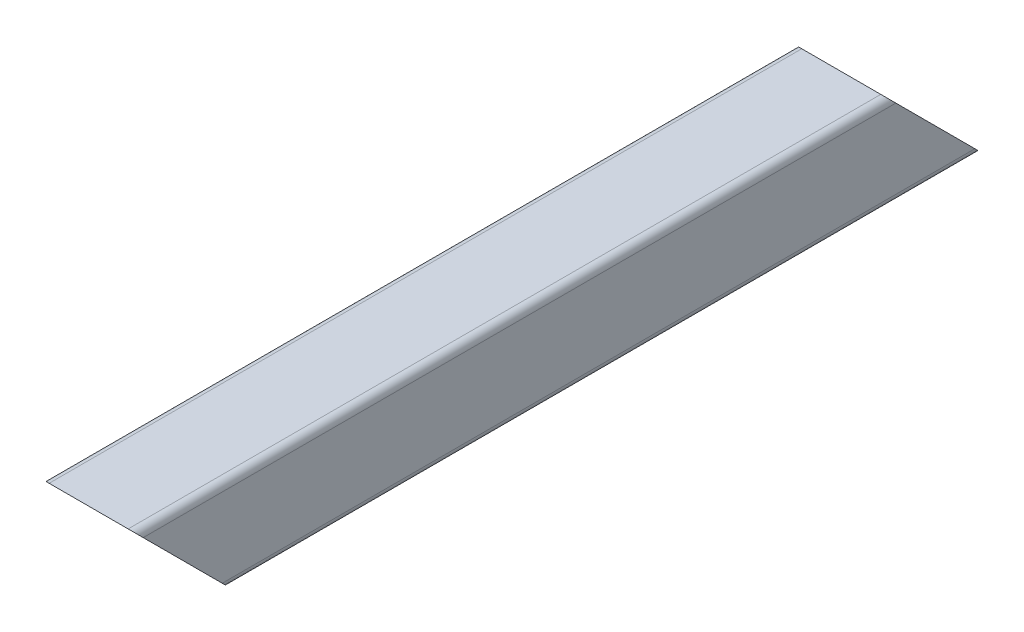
from build123d import *

# Parameters (mm, degrees)
BASE_EXTRUSION_DEPTH    = 450
ENL_V_MAT_EXTRU_1_DEPTH = 456.521678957


with BuildPart() as part:
    # Esquisse1 → Base-Extrusion (new body)
    with BuildSketch(Plane.XY):
        with BuildLine():
            Line((4, 0), (46, 0))
            ThreePointArc((46, 0), (48.828427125, -1.171572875), (50, -4))
            Line((50, -4), (50, -46))
            ThreePointArc((50, -46), (48.828427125, -48.828427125), (46, -50))
            Line((46, -50), (4, -50))
            ThreePointArc((4, -50), (1.171572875, -48.828427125), (0, -46))
            Line((0, -46), (0, -4))
            ThreePointArc((0, -4), (1.171572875, -1.171572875), (4, 0))
        make_face()
        with BuildLine():
            Line((3, -4), (3, -46))
            ThreePointArc((3, -46), (3.292893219, -46.707106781), (4, -47))
            Line((4, -47), (46, -47))
            ThreePointArc((46, -47), (46.707106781, -46.707106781), (47, -46))
            Line((47, -46), (47, -4))
            ThreePointArc((47, -4), (46.707106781, -3.292893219), (46, -3))
            Line((46, -3), (4, -3))
            ThreePointArc((4, -3), (3.292893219, -3.292893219), (3, -4))
        make_face(mode=Mode.SUBTRACT)
    extrude(amount=BASE_EXTRUSION_DEPTH)

    # Esquisse2 → Enl_v. mat.-Extru.1 (cut, through all)
    with BuildSketch(Plane.ZY):
        Polygon((450, 0), (400, -50), (450, -50), align=None)
        Polygon((0, -50), (50, 0), (0, 0), align=None)
    extrude(amount=-ENL_V_MAT_EXTRU_1_DEPTH, mode=Mode.SUBTRACT)


solid = part.part
